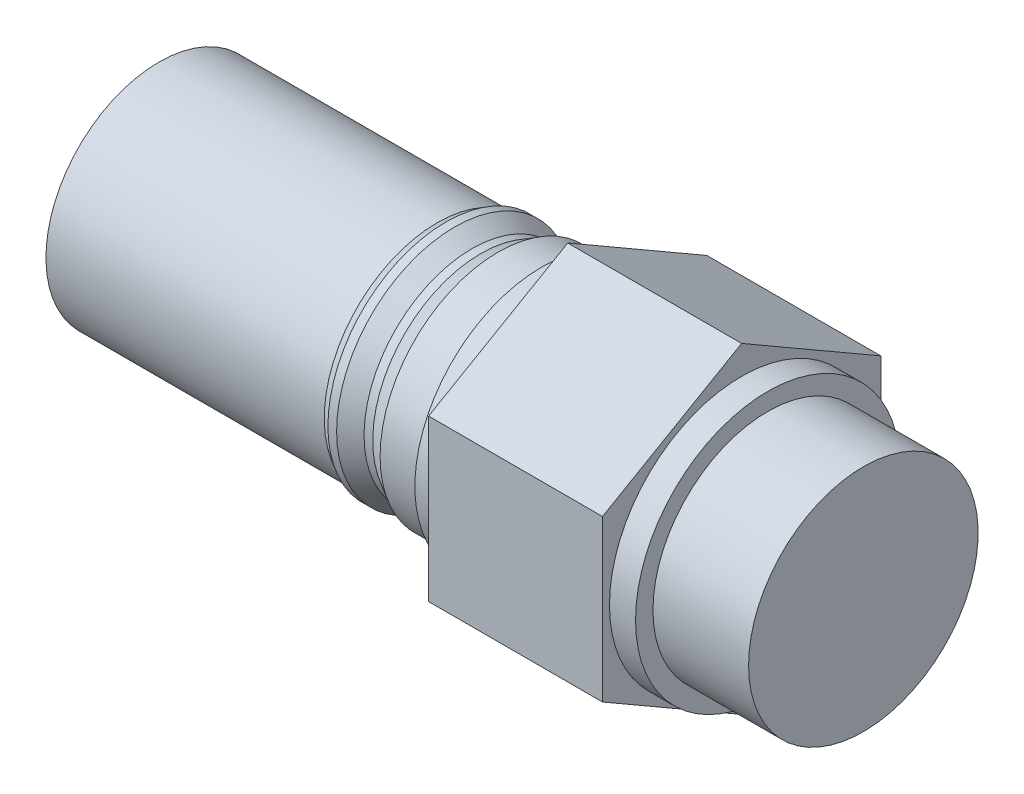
ISO-10303-21;
HEADER;
FILE_DESCRIPTION(('STEP AP214'),'2;1');
FILE_NAME('part.step','',(''),(''),'','','');
FILE_SCHEMA(('AUTOMOTIVE_DESIGN { 1 0 10303 214 1 1 1 1 }'));
ENDSEC;
DATA;
#1=APPLICATION_CONTEXT('core data for automotive mechanical design processes');
#2=APPLICATION_PROTOCOL_DEFINITION('international standard','automotive_design',2000,#1);
#3=PRODUCT_CONTEXT('',#1,'mechanical');
#4=PRODUCT('Part','Part','',(#3));
#5=PRODUCT_RELATED_PRODUCT_CATEGORY('part','',(#4));
#6=PRODUCT_DEFINITION_FORMATION('','',#4);
#7=PRODUCT_DEFINITION_CONTEXT('part definition',#1,'design');
#8=PRODUCT_DEFINITION('design','',#6,#7);
#9=PRODUCT_DEFINITION_SHAPE('','',#8);
#10=(LENGTH_UNIT() NAMED_UNIT(*) SI_UNIT(.MILLI.,.METRE.));
#11=(NAMED_UNIT(*) PLANE_ANGLE_UNIT() SI_UNIT($,.RADIAN.));
#12=(NAMED_UNIT(*) SI_UNIT($,.STERADIAN.) SOLID_ANGLE_UNIT());
#13=UNCERTAINTY_MEASURE_WITH_UNIT(LENGTH_MEASURE(1.E-05),#10,'distance_accuracy_value','');
#14=(GEOMETRIC_REPRESENTATION_CONTEXT(3) GLOBAL_UNCERTAINTY_ASSIGNED_CONTEXT((#13)) GLOBAL_UNIT_ASSIGNED_CONTEXT((#10,
#11,#12)) REPRESENTATION_CONTEXT('',''));
#15=CARTESIAN_POINT('',(0.,0.,0.));
#16=DIRECTION('',(0.,0.,1.));
#17=DIRECTION('',(1.,0.,0.));
#18=AXIS2_PLACEMENT_3D('',#15,#16,#17);
#19=CARTESIAN_POINT('',(0.,0.,0.));
#20=DIRECTION('',(-1.,0.,0.));
#21=DIRECTION('',(0.,-1.,0.));
#22=AXIS2_PLACEMENT_3D('',#19,#20,#21);
#23=PLANE('',#22);
#24=CARTESIAN_POINT('',(0.,0.,0.));
#25=DIRECTION('',(1.,0.,0.));
#26=DIRECTION('',(0.,1.,0.));
#27=AXIS2_PLACEMENT_3D('',#24,#25,#26);
#28=CIRCLE('',#27,13.);
#29=CARTESIAN_POINT('',(0.,13.,0.));
#30=VERTEX_POINT('',#29);
#31=EDGE_CURVE('E11',#30,#30,#28,.T.);
#32=ORIENTED_EDGE('',*,*,#31,.F.);
#33=EDGE_LOOP('',(#32));
#34=FACE_BOUND('',#33,.T.);
#35=ADVANCED_FACE('F33',(#34),#23,.T.);
#36=CARTESIAN_POINT('',(47.,0.,0.));
#37=DIRECTION('',(1.,0.,0.));
#38=DIRECTION('',(0.,1.,0.));
#39=AXIS2_PLACEMENT_3D('',#36,#37,#38);
#40=CYLINDRICAL_SURFACE('',#39,13.);
#41=ORIENTED_EDGE('',*,*,#31,.T.);
#42=EDGE_LOOP('',(#41));
#43=FACE_BOUND('',#42,.T.);
#44=CARTESIAN_POINT('',(32.,0.,0.));
#45=DIRECTION('',(1.,0.,0.));
#46=DIRECTION('',(0.,1.,0.));
#47=AXIS2_PLACEMENT_3D('',#44,#45,#46);
#48=CIRCLE('',#47,13.);
#49=CARTESIAN_POINT('',(32.,13.,0.));
#50=VERTEX_POINT('',#49);
#51=EDGE_CURVE('E41',#50,#50,#48,.T.);
#52=ORIENTED_EDGE('',*,*,#51,.F.);
#53=EDGE_LOOP('',(#52));
#54=FACE_BOUND('',#53,.T.);
#55=ADVANCED_FACE('F167',(#43,#54),#40,.T.);
#56=CARTESIAN_POINT('',(33.,0.,0.));
#57=DIRECTION('',(1.,0.,0.));
#58=DIRECTION('',(0.,1.,0.));
#59=AXIS2_PLACEMENT_3D('',#56,#57,#58);
#60=CONICAL_SURFACE('',#59,13.5773502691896,0.5235987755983);
#61=ORIENTED_EDGE('',*,*,#51,.T.);
#62=EDGE_LOOP('',(#61));
#63=FACE_BOUND('',#62,.T.);
#64=CARTESIAN_POINT('',(33.,0.,0.));
#65=DIRECTION('',(1.,0.,0.));
#66=DIRECTION('',(0.,1.,0.));
#67=AXIS2_PLACEMENT_3D('',#64,#65,#66);
#68=CIRCLE('',#67,13.5773502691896);
#69=CARTESIAN_POINT('',(33.,13.5773502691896,0.));
#70=VERTEX_POINT('',#69);
#71=EDGE_CURVE('E159',#70,#70,#68,.T.);
#72=ORIENTED_EDGE('',*,*,#71,.F.);
#73=EDGE_LOOP('',(#72));
#74=FACE_BOUND('',#73,.T.);
#75=ADVANCED_FACE('F164',(#63,#74),#60,.T.);
#76=CARTESIAN_POINT('',(47.,0.,0.));
#77=DIRECTION('',(1.,0.,0.));
#78=DIRECTION('',(0.,1.,0.));
#79=AXIS2_PLACEMENT_3D('',#76,#77,#78);
#80=CYLINDRICAL_SURFACE('',#79,13.5773502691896);
#81=ORIENTED_EDGE('',*,*,#71,.T.);
#82=EDGE_LOOP('',(#81));
#83=FACE_BOUND('',#82,.T.);
#84=CARTESIAN_POINT('',(34.,0.,0.));
#85=DIRECTION('',(1.,0.,0.));
#86=DIRECTION('',(0.,1.,0.));
#87=AXIS2_PLACEMENT_3D('',#84,#85,#86);
#88=CIRCLE('',#87,13.5773502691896);
#89=CARTESIAN_POINT('',(34.,13.5773502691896,0.));
#90=VERTEX_POINT('',#89);
#91=EDGE_CURVE('E156',#90,#90,#88,.T.);
#92=ORIENTED_EDGE('',*,*,#91,.F.);
#93=EDGE_LOOP('',(#92));
#94=FACE_BOUND('',#93,.T.);
#95=ADVANCED_FACE('F174',(#83,#94),#80,.T.);
#96=CARTESIAN_POINT('',(36.,0.,0.));
#97=DIRECTION('',(-1.,0.,0.));
#98=DIRECTION('',(0.,-1.,0.));
#99=AXIS2_PLACEMENT_3D('',#96,#97,#98);
#100=CONICAL_SURFACE('',#99,12.4226497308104,0.523598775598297);
#101=ORIENTED_EDGE('',*,*,#91,.T.);
#102=EDGE_LOOP('',(#101));
#103=FACE_BOUND('',#102,.T.);
#104=CARTESIAN_POINT('',(36.,0.,0.));
#105=DIRECTION('',(1.,0.,0.));
#106=DIRECTION('',(0.,1.,0.));
#107=AXIS2_PLACEMENT_3D('',#104,#105,#106);
#108=CIRCLE('',#107,12.4226497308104);
#109=CARTESIAN_POINT('',(36.,12.4226497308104,0.));
#110=VERTEX_POINT('',#109);
#111=EDGE_CURVE('E153',#110,#110,#108,.T.);
#112=ORIENTED_EDGE('',*,*,#111,.F.);
#113=EDGE_LOOP('',(#112));
#114=FACE_BOUND('',#113,.T.);
#115=ADVANCED_FACE('F180',(#103,#114),#100,.T.);
#116=CARTESIAN_POINT('',(47.,0.,0.));
#117=DIRECTION('',(1.,0.,0.));
#118=DIRECTION('',(0.,1.,0.));
#119=AXIS2_PLACEMENT_3D('',#116,#117,#118);
#120=CYLINDRICAL_SURFACE('',#119,12.4226497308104);
#121=ORIENTED_EDGE('',*,*,#111,.T.);
#122=EDGE_LOOP('',(#121));
#123=FACE_BOUND('',#122,.T.);
#124=CARTESIAN_POINT('',(37.,0.,0.));
#125=DIRECTION('',(1.,0.,0.));
#126=DIRECTION('',(0.,1.,0.));
#127=AXIS2_PLACEMENT_3D('',#124,#125,#126);
#128=CIRCLE('',#127,12.4226497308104);
#129=CARTESIAN_POINT('',(37.,12.4226497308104,0.));
#130=VERTEX_POINT('',#129);
#131=EDGE_CURVE('E150',#130,#130,#128,.T.);
#132=ORIENTED_EDGE('',*,*,#131,.F.);
#133=EDGE_LOOP('',(#132));
#134=FACE_BOUND('',#133,.T.);
#135=ADVANCED_FACE('F184',(#123,#134),#120,.T.);
#136=CARTESIAN_POINT('',(39.,0.,0.));
#137=DIRECTION('',(1.,0.,0.));
#138=DIRECTION('',(0.,1.,0.));
#139=AXIS2_PLACEMENT_3D('',#136,#137,#138);
#140=CONICAL_SURFACE('',#139,13.5773502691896,0.523598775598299);
#141=ORIENTED_EDGE('',*,*,#131,.T.);
#142=EDGE_LOOP('',(#141));
#143=FACE_BOUND('',#142,.T.);
#144=CARTESIAN_POINT('',(39.,0.,0.));
#145=DIRECTION('',(1.,0.,0.));
#146=DIRECTION('',(0.,1.,0.));
#147=AXIS2_PLACEMENT_3D('',#144,#145,#146);
#148=CIRCLE('',#147,13.5773502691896);
#149=CARTESIAN_POINT('',(39.,13.5773502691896,0.));
#150=VERTEX_POINT('',#149);
#151=EDGE_CURVE('E147',#150,#150,#148,.T.);
#152=ORIENTED_EDGE('',*,*,#151,.F.);
#153=EDGE_LOOP('',(#152));
#154=FACE_BOUND('',#153,.T.);
#155=ADVANCED_FACE('F188',(#143,#154),#140,.T.);
#156=CARTESIAN_POINT('',(47.,0.,0.));
#157=DIRECTION('',(1.,0.,0.));
#158=DIRECTION('',(0.,1.,0.));
#159=AXIS2_PLACEMENT_3D('',#156,#157,#158);
#160=CYLINDRICAL_SURFACE('',#159,13.5773502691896);
#161=ORIENTED_EDGE('',*,*,#151,.T.);
#162=EDGE_LOOP('',(#161));
#163=FACE_BOUND('',#162,.T.);
#164=CARTESIAN_POINT('',(44.,0.,0.));
#165=DIRECTION('',(1.,0.,0.));
#166=DIRECTION('',(0.,1.,0.));
#167=AXIS2_PLACEMENT_3D('',#164,#165,#166);
#168=CIRCLE('',#167,13.5773502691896);
#169=CARTESIAN_POINT('',(44.,13.5773502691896,0.));
#170=VERTEX_POINT('',#169);
#171=EDGE_CURVE('E144',#170,#170,#168,.T.);
#172=ORIENTED_EDGE('',*,*,#171,.F.);
#173=EDGE_LOOP('',(#172));
#174=FACE_BOUND('',#173,.T.);
#175=ADVANCED_FACE('F192',(#163,#174),#160,.T.);
#176=CARTESIAN_POINT('',(44.,13.5773502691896,0.));
#177=DIRECTION('',(-1.,0.,0.));
#178=DIRECTION('',(0.,-1.,0.));
#179=AXIS2_PLACEMENT_3D('',#176,#177,#178);
#180=PLANE('',#179);
#181=ORIENTED_EDGE('',*,*,#171,.T.);
#182=EDGE_LOOP('',(#181));
#183=FACE_BOUND('',#182,.T.);
#184=CARTESIAN_POINT('',(44.,0.,0.));
#185=DIRECTION('',(1.,0.,0.));
#186=DIRECTION('',(0.,1.,0.));
#187=AXIS2_PLACEMENT_3D('',#184,#185,#186);
#188=CIRCLE('',#187,14.5773502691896);
#189=CARTESIAN_POINT('',(44.,14.5773502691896,0.));
#190=VERTEX_POINT('',#189);
#191=EDGE_CURVE('E141',#190,#190,#188,.T.);
#192=ORIENTED_EDGE('',*,*,#191,.F.);
#193=EDGE_LOOP('',(#192));
#194=FACE_BOUND('',#193,.T.);
#195=ADVANCED_FACE('F196',(#183,#194),#180,.T.);
#196=CARTESIAN_POINT('',(47.,0.,0.));
#197=DIRECTION('',(1.,0.,0.));
#198=DIRECTION('',(0.,1.,0.));
#199=AXIS2_PLACEMENT_3D('',#196,#197,#198);
#200=CYLINDRICAL_SURFACE('',#199,14.5773502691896);
#201=ORIENTED_EDGE('',*,*,#191,.T.);
#202=EDGE_LOOP('',(#201));
#203=FACE_BOUND('',#202,.T.);
#204=CARTESIAN_POINT('',(47.,0.,0.));
#205=DIRECTION('',(1.,0.,0.));
#206=DIRECTION('',(0.,1.,0.));
#207=AXIS2_PLACEMENT_3D('',#204,#205,#206);
#208=CIRCLE('',#207,14.5773502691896);
#209=CARTESIAN_POINT('',(47.,14.5773502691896,0.));
#210=VERTEX_POINT('',#209);
#211=EDGE_CURVE('E138',#210,#210,#208,.T.);
#212=ORIENTED_EDGE('',*,*,#211,.F.);
#213=EDGE_LOOP('',(#212));
#214=FACE_BOUND('',#213,.T.);
#215=ADVANCED_FACE('F200',(#203,#214),#200,.T.);
#216=CARTESIAN_POINT('',(67.,9.23760430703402,-16.));
#217=DIRECTION('',(0.,-0.866025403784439,0.5));
#218=DIRECTION('',(0.,-0.5,-0.866025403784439));
#219=AXIS2_PLACEMENT_3D('',#216,#217,#218);
#220=PLANE('',#219);
#221=DIRECTION('',(0.,0.5,0.866025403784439));
#222=VECTOR('',#221,1.);
#223=CARTESIAN_POINT('',(47.,9.23760430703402,-16.));
#224=LINE('',#223,#222);
#225=CARTESIAN_POINT('',(47.,9.23760430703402,-16.));
#226=VERTEX_POINT('',#225);
#227=CARTESIAN_POINT('',(47.,18.475208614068,0.));
#228=VERTEX_POINT('',#227);
#229=EDGE_CURVE('E118',#226,#228,#224,.T.);
#230=ORIENTED_EDGE('',*,*,#229,.T.);
#231=DIRECTION('',(-1.,0.,0.));
#232=VECTOR('',#231,1.);
#233=CARTESIAN_POINT('',(67.,18.475208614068,0.));
#234=LINE('',#233,#232);
#235=CARTESIAN_POINT('',(67.,18.475208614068,0.));
#236=VERTEX_POINT('',#235);
#237=EDGE_CURVE('E136',#236,#228,#234,.T.);
#238=ORIENTED_EDGE('',*,*,#237,.F.);
#239=DIRECTION('',(0.,0.5,0.866025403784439));
#240=VECTOR('',#239,1.);
#241=CARTESIAN_POINT('',(67.,9.23760430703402,-16.));
#242=LINE('',#241,#240);
#243=CARTESIAN_POINT('',(67.,9.23760430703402,-16.));
#244=VERTEX_POINT('',#243);
#245=EDGE_CURVE('E129',#244,#236,#242,.T.);
#246=ORIENTED_EDGE('',*,*,#245,.F.);
#247=DIRECTION('',(-1.,0.,0.));
#248=VECTOR('',#247,1.);
#249=CARTESIAN_POINT('',(67.,9.23760430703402,-16.));
#250=LINE('',#249,#248);
#251=EDGE_CURVE('E114',#244,#226,#250,.T.);
#252=ORIENTED_EDGE('',*,*,#251,.T.);
#253=EDGE_LOOP('',(#230,#238,#246,#252));
#254=FACE_BOUND('',#253,.T.);
#255=ADVANCED_FACE('F204',(#254),#220,.F.);
#256=CARTESIAN_POINT('',(67.,18.475208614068,0.));
#257=DIRECTION('',(0.,-0.866025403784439,-0.5));
#258=DIRECTION('',(0.,0.5,-0.866025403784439));
#259=AXIS2_PLACEMENT_3D('',#256,#257,#258);
#260=PLANE('',#259);
#261=DIRECTION('',(0.,-0.5,0.866025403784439));
#262=VECTOR('',#261,1.);
#263=CARTESIAN_POINT('',(47.,18.475208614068,0.));
#264=LINE('',#263,#262);
#265=CARTESIAN_POINT('',(47.,9.23760430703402,16.));
#266=VERTEX_POINT('',#265);
#267=EDGE_CURVE('E121',#228,#266,#264,.T.);
#268=ORIENTED_EDGE('',*,*,#267,.T.);
#269=DIRECTION('',(-1.,0.,0.));
#270=VECTOR('',#269,1.);
#271=CARTESIAN_POINT('',(67.,9.23760430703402,16.));
#272=LINE('',#271,#270);
#273=CARTESIAN_POINT('',(67.,9.23760430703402,16.));
#274=VERTEX_POINT('',#273);
#275=EDGE_CURVE('E133',#274,#266,#272,.T.);
#276=ORIENTED_EDGE('',*,*,#275,.F.);
#277=DIRECTION('',(0.,-0.5,0.866025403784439));
#278=VECTOR('',#277,1.);
#279=CARTESIAN_POINT('',(67.,18.475208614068,0.));
#280=LINE('',#279,#278);
#281=EDGE_CURVE('E87',#236,#274,#280,.T.);
#282=ORIENTED_EDGE('',*,*,#281,.F.);
#283=ORIENTED_EDGE('',*,*,#237,.T.);
#284=EDGE_LOOP('',(#268,#276,#282,#283));
#285=FACE_BOUND('',#284,.T.);
#286=ADVANCED_FACE('F208',(#285),#260,.F.);
#287=CARTESIAN_POINT('',(67.,9.23760430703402,16.));
#288=DIRECTION('',(0.,0.,-1.));
#289=DIRECTION('',(-1.,0.,0.));
#290=AXIS2_PLACEMENT_3D('',#287,#288,#289);
#291=PLANE('',#290);
#292=DIRECTION('',(0.,-1.,0.));
#293=VECTOR('',#292,1.);
#294=CARTESIAN_POINT('',(47.,9.23760430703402,16.));
#295=LINE('',#294,#293);
#296=CARTESIAN_POINT('',(47.,-9.23760430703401,16.));
#297=VERTEX_POINT('',#296);
#298=EDGE_CURVE('E124',#266,#297,#295,.T.);
#299=ORIENTED_EDGE('',*,*,#298,.T.);
#300=DIRECTION('',(-1.,0.,0.));
#301=VECTOR('',#300,1.);
#302=CARTESIAN_POINT('',(67.,-9.23760430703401,16.));
#303=LINE('',#302,#301);
#304=CARTESIAN_POINT('',(67.,-9.23760430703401,16.));
#305=VERTEX_POINT('',#304);
#306=EDGE_CURVE('E109',#305,#297,#303,.T.);
#307=ORIENTED_EDGE('',*,*,#306,.F.);
#308=DIRECTION('',(0.,-1.,0.));
#309=VECTOR('',#308,1.);
#310=CARTESIAN_POINT('',(67.,9.23760430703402,16.));
#311=LINE('',#310,#309);
#312=EDGE_CURVE('E100',#274,#305,#311,.T.);
#313=ORIENTED_EDGE('',*,*,#312,.F.);
#314=ORIENTED_EDGE('',*,*,#275,.T.);
#315=EDGE_LOOP('',(#299,#307,#313,#314));
#316=FACE_BOUND('',#315,.T.);
#317=ADVANCED_FACE('F212',(#316),#291,.F.);
#318=CARTESIAN_POINT('',(67.,-9.23760430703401,16.));
#319=DIRECTION('',(0.,0.866025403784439,-0.5));
#320=DIRECTION('',(0.,0.5,0.866025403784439));
#321=AXIS2_PLACEMENT_3D('',#318,#319,#320);
#322=PLANE('',#321);
#323=DIRECTION('',(0.,-0.5,-0.866025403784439));
#324=VECTOR('',#323,1.);
#325=CARTESIAN_POINT('',(47.,-9.23760430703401,16.));
#326=LINE('',#325,#324);
#327=CARTESIAN_POINT('',(47.,-18.475208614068,0.));
#328=VERTEX_POINT('',#327);
#329=EDGE_CURVE('E108',#297,#328,#326,.T.);
#330=ORIENTED_EDGE('',*,*,#329,.T.);
#331=DIRECTION('',(-1.,0.,0.));
#332=VECTOR('',#331,1.);
#333=CARTESIAN_POINT('',(67.,-18.475208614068,0.));
#334=LINE('',#333,#332);
#335=CARTESIAN_POINT('',(67.,-18.475208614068,0.));
#336=VERTEX_POINT('',#335);
#337=EDGE_CURVE('E105',#336,#328,#334,.T.);
#338=ORIENTED_EDGE('',*,*,#337,.F.);
#339=DIRECTION('',(0.,-0.5,-0.866025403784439));
#340=VECTOR('',#339,1.);
#341=CARTESIAN_POINT('',(67.,-9.23760430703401,16.));
#342=LINE('',#341,#340);
#343=EDGE_CURVE('E94',#305,#336,#342,.T.);
#344=ORIENTED_EDGE('',*,*,#343,.F.);
#345=ORIENTED_EDGE('',*,*,#306,.T.);
#346=EDGE_LOOP('',(#330,#338,#344,#345));
#347=FACE_BOUND('',#346,.T.);
#348=ADVANCED_FACE('F106',(#347),#322,.F.);
#349=CARTESIAN_POINT('',(67.,-18.475208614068,0.));
#350=DIRECTION('',(0.,0.866025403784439,0.5));
#351=DIRECTION('',(0.,-0.5,0.866025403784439));
#352=AXIS2_PLACEMENT_3D('',#349,#350,#351);
#353=PLANE('',#352);
#354=DIRECTION('',(0.,0.5,-0.866025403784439));
#355=VECTOR('',#354,1.);
#356=CARTESIAN_POINT('',(47.,-18.475208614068,0.));
#357=LINE('',#356,#355);
#358=CARTESIAN_POINT('',(47.,-9.23760430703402,-16.));
#359=VERTEX_POINT('',#358);
#360=EDGE_CURVE('E72',#328,#359,#357,.T.);
#361=ORIENTED_EDGE('',*,*,#360,.T.);
#362=DIRECTION('',(-1.,0.,0.));
#363=VECTOR('',#362,1.);
#364=CARTESIAN_POINT('',(67.,-9.23760430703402,-16.));
#365=LINE('',#364,#363);
#366=CARTESIAN_POINT('',(67.,-9.23760430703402,-16.));
#367=VERTEX_POINT('',#366);
#368=EDGE_CURVE('E110',#367,#359,#365,.T.);
#369=ORIENTED_EDGE('',*,*,#368,.F.);
#370=DIRECTION('',(0.,0.5,-0.866025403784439));
#371=VECTOR('',#370,1.);
#372=CARTESIAN_POINT('',(67.,-18.475208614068,0.));
#373=LINE('',#372,#371);
#374=EDGE_CURVE('E98',#336,#367,#373,.T.);
#375=ORIENTED_EDGE('',*,*,#374,.F.);
#376=ORIENTED_EDGE('',*,*,#337,.T.);
#377=EDGE_LOOP('',(#361,#369,#375,#376));
#378=FACE_BOUND('',#377,.T.);
#379=ADVANCED_FACE('F112',(#378),#353,.F.);
#380=CARTESIAN_POINT('',(67.,-9.23760430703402,-16.));
#381=DIRECTION('',(0.,0.,1.));
#382=DIRECTION('',(1.,0.,0.));
#383=AXIS2_PLACEMENT_3D('',#380,#381,#382);
#384=PLANE('',#383);
#385=DIRECTION('',(0.,1.,0.));
#386=VECTOR('',#385,1.);
#387=CARTESIAN_POINT('',(47.,-9.23760430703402,-16.));
#388=LINE('',#387,#386);
#389=EDGE_CURVE('E78',#359,#226,#388,.T.);
#390=ORIENTED_EDGE('',*,*,#389,.T.);
#391=ORIENTED_EDGE('',*,*,#251,.F.);
#392=DIRECTION('',(0.,1.,0.));
#393=VECTOR('',#392,1.);
#394=CARTESIAN_POINT('',(67.,-9.23760430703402,-16.));
#395=LINE('',#394,#393);
#396=EDGE_CURVE('E49',#367,#244,#395,.T.);
#397=ORIENTED_EDGE('',*,*,#396,.F.);
#398=ORIENTED_EDGE('',*,*,#368,.T.);
#399=EDGE_LOOP('',(#390,#391,#397,#398));
#400=FACE_BOUND('',#399,.T.);
#401=ADVANCED_FACE('F220',(#400),#384,.F.);
#402=CARTESIAN_POINT('',(67.,0.,0.));
#403=DIRECTION('',(1.,0.,0.));
#404=DIRECTION('',(0.,0.,-1.));
#405=AXIS2_PLACEMENT_3D('',#402,#403,#404);
#406=PLANE('',#405);
#407=CARTESIAN_POINT('',(67.,0.,0.));
#408=DIRECTION('',(-1.,0.,0.));
#409=DIRECTION('',(0.,0.,1.));
#410=AXIS2_PLACEMENT_3D('',#407,#408,#409);
#411=CIRCLE('',#410,15.2);
#412=CARTESIAN_POINT('',(67.,0.,15.2));
#413=VERTEX_POINT('',#412);
#414=EDGE_CURVE('E250',#413,#413,#411,.T.);
#415=ORIENTED_EDGE('',*,*,#414,.T.);
#416=EDGE_LOOP('',(#415));
#417=FACE_BOUND('',#416,.T.);
#418=ORIENTED_EDGE('',*,*,#245,.T.);
#419=ORIENTED_EDGE('',*,*,#281,.T.);
#420=ORIENTED_EDGE('',*,*,#312,.T.);
#421=ORIENTED_EDGE('',*,*,#343,.T.);
#422=ORIENTED_EDGE('',*,*,#374,.T.);
#423=ORIENTED_EDGE('',*,*,#396,.T.);
#424=EDGE_LOOP('',(#418,#419,#420,#421,#422,#423));
#425=FACE_BOUND('',#424,.T.);
#426=ADVANCED_FACE('F96',(#417,#425),#406,.T.);
#427=CARTESIAN_POINT('',(47.,0.,0.));
#428=DIRECTION('',(1.,0.,0.));
#429=DIRECTION('',(0.,0.,-1.));
#430=AXIS2_PLACEMENT_3D('',#427,#428,#429);
#431=PLANE('',#430);
#432=ORIENTED_EDGE('',*,*,#211,.T.);
#433=EDGE_LOOP('',(#432));
#434=FACE_BOUND('',#433,.T.);
#435=ORIENTED_EDGE('',*,*,#229,.F.);
#436=ORIENTED_EDGE('',*,*,#389,.F.);
#437=ORIENTED_EDGE('',*,*,#360,.F.);
#438=ORIENTED_EDGE('',*,*,#329,.F.);
#439=ORIENTED_EDGE('',*,*,#298,.F.);
#440=ORIENTED_EDGE('',*,*,#267,.F.);
#441=EDGE_LOOP('',(#435,#436,#437,#438,#439,#440));
#442=FACE_BOUND('',#441,.T.);
#443=ADVANCED_FACE('F223',(#434,#442),#431,.F.);
#444=CARTESIAN_POINT('',(81.,0.,0.));
#445=DIRECTION('',(-1.,0.,0.));
#446=DIRECTION('',(0.,0.,1.));
#447=AXIS2_PLACEMENT_3D('',#444,#445,#446);
#448=PLANE('',#447);
#449=CARTESIAN_POINT('',(81.,0.,0.));
#450=DIRECTION('',(-1.,0.,0.));
#451=DIRECTION('',(0.,0.,1.));
#452=AXIS2_PLACEMENT_3D('',#449,#450,#451);
#453=CIRCLE('',#452,13.2);
#454=CARTESIAN_POINT('',(81.,0.,13.2));
#455=VERTEX_POINT('',#454);
#456=EDGE_CURVE('E122',#455,#455,#453,.T.);
#457=ORIENTED_EDGE('',*,*,#456,.F.);
#458=EDGE_LOOP('',(#457));
#459=FACE_BOUND('',#458,.T.);
#460=ADVANCED_FACE('F226',(#459),#448,.F.);
#461=CARTESIAN_POINT('',(67.,0.,0.));
#462=DIRECTION('',(-1.,0.,0.));
#463=DIRECTION('',(0.,0.,1.));
#464=AXIS2_PLACEMENT_3D('',#461,#462,#463);
#465=CYLINDRICAL_SURFACE('',#464,13.2);
#466=CARTESIAN_POINT('',(70.,0.,0.));
#467=DIRECTION('',(-1.,0.,0.));
#468=DIRECTION('',(0.,0.,1.));
#469=AXIS2_PLACEMENT_3D('',#466,#467,#468);
#470=CIRCLE('',#469,13.2);
#471=CARTESIAN_POINT('',(70.,0.,13.2));
#472=VERTEX_POINT('',#471);
#473=EDGE_CURVE('E254',#472,#472,#470,.T.);
#474=ORIENTED_EDGE('',*,*,#473,.F.);
#475=EDGE_LOOP('',(#474));
#476=FACE_BOUND('',#475,.T.);
#477=ORIENTED_EDGE('',*,*,#456,.T.);
#478=EDGE_LOOP('',(#477));
#479=FACE_BOUND('',#478,.T.);
#480=ADVANCED_FACE('F233',(#476,#479),#465,.T.);
#481=CARTESIAN_POINT('',(70.,13.2,0.));
#482=DIRECTION('',(-1.,0.,0.));
#483=DIRECTION('',(0.,0.,1.));
#484=AXIS2_PLACEMENT_3D('',#481,#482,#483);
#485=PLANE('',#484);
#486=CARTESIAN_POINT('',(70.,0.,0.));
#487=DIRECTION('',(-1.,0.,0.));
#488=DIRECTION('',(0.,0.,1.));
#489=AXIS2_PLACEMENT_3D('',#486,#487,#488);
#490=CIRCLE('',#489,15.2);
#491=CARTESIAN_POINT('',(70.,0.,15.2));
#492=VERTEX_POINT('',#491);
#493=EDGE_CURVE('E253',#492,#492,#490,.T.);
#494=ORIENTED_EDGE('',*,*,#493,.F.);
#495=EDGE_LOOP('',(#494));
#496=FACE_BOUND('',#495,.T.);
#497=ORIENTED_EDGE('',*,*,#473,.T.);
#498=EDGE_LOOP('',(#497));
#499=FACE_BOUND('',#498,.T.);
#500=ADVANCED_FACE('F237',(#496,#499),#485,.F.);
#501=CARTESIAN_POINT('',(67.,0.,0.));
#502=DIRECTION('',(-1.,0.,0.));
#503=DIRECTION('',(0.,0.,1.));
#504=AXIS2_PLACEMENT_3D('',#501,#502,#503);
#505=CYLINDRICAL_SURFACE('',#504,15.2);
#506=ORIENTED_EDGE('',*,*,#414,.F.);
#507=EDGE_LOOP('',(#506));
#508=FACE_BOUND('',#507,.T.);
#509=ORIENTED_EDGE('',*,*,#493,.T.);
#510=EDGE_LOOP('',(#509));
#511=FACE_BOUND('',#510,.T.);
#512=ADVANCED_FACE('F241',(#508,#511),#505,.T.);
#513=CLOSED_SHELL('',(#35,#55,#75,#95,#115,#135,#155,#175,#195,#215,#255,#286,#317,#348,#379,
#401,#426,#443,#460,#480,#500,#512));
#514=MANIFOLD_SOLID_BREP('B2',#513);
#515=ADVANCED_BREP_SHAPE_REPRESENTATION('',(#18,#514),#14);
#516=SHAPE_DEFINITION_REPRESENTATION(#9,#515);
ENDSEC;
END-ISO-10303-21;
